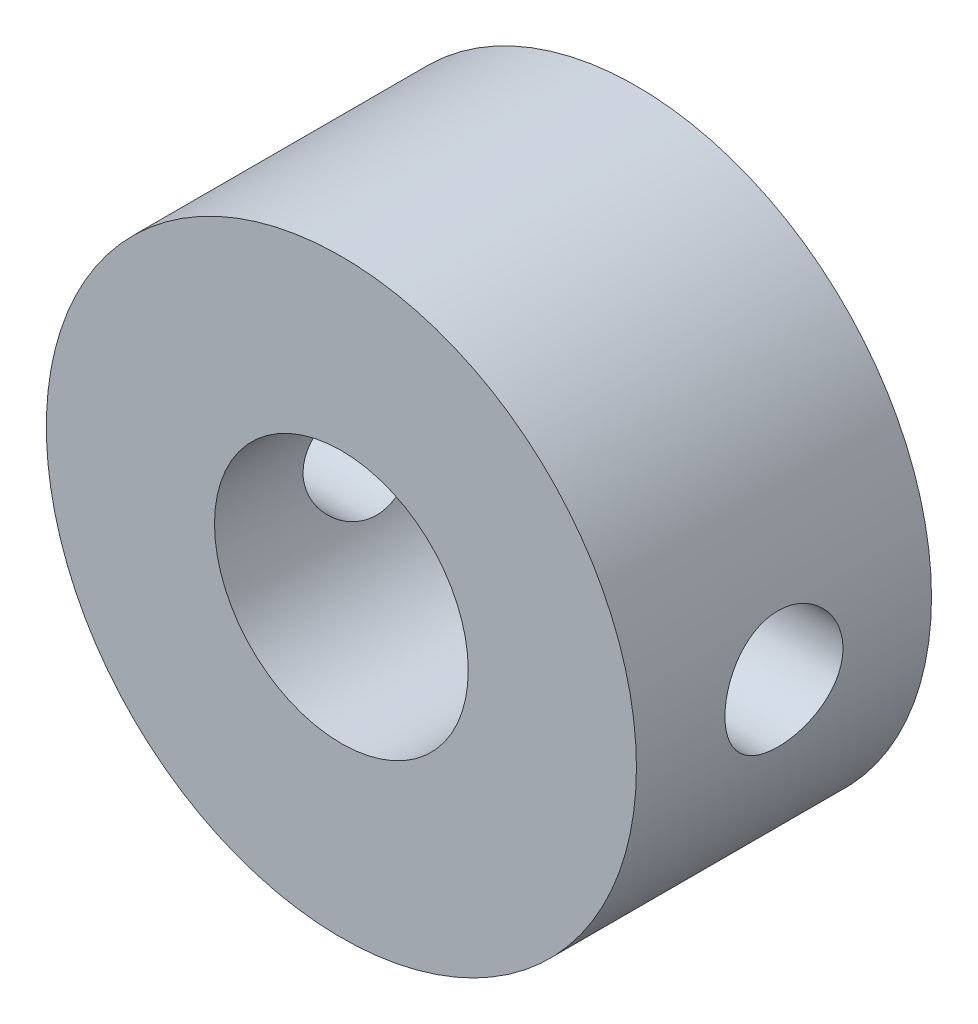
ISO-10303-21;
HEADER;
FILE_DESCRIPTION(('STEP AP214'),'2;1');
FILE_NAME('part.step','',(''),(''),'','','');
FILE_SCHEMA(('AUTOMOTIVE_DESIGN { 1 0 10303 214 1 1 1 1 }'));
ENDSEC;
DATA;
#1=APPLICATION_CONTEXT('core data for automotive mechanical design processes');
#2=APPLICATION_PROTOCOL_DEFINITION('international standard','automotive_design',2000,#1);
#3=PRODUCT_CONTEXT('',#1,'mechanical');
#4=PRODUCT('Part','Part','',(#3));
#5=PRODUCT_RELATED_PRODUCT_CATEGORY('part','',(#4));
#6=PRODUCT_DEFINITION_FORMATION('','',#4);
#7=PRODUCT_DEFINITION_CONTEXT('part definition',#1,'design');
#8=PRODUCT_DEFINITION('design','',#6,#7);
#9=PRODUCT_DEFINITION_SHAPE('','',#8);
#10=(LENGTH_UNIT() NAMED_UNIT(*) SI_UNIT(.MILLI.,.METRE.));
#11=(NAMED_UNIT(*) PLANE_ANGLE_UNIT() SI_UNIT($,.RADIAN.));
#12=(NAMED_UNIT(*) SI_UNIT($,.STERADIAN.) SOLID_ANGLE_UNIT());
#13=UNCERTAINTY_MEASURE_WITH_UNIT(LENGTH_MEASURE(1.E-05),#10,'distance_accuracy_value','');
#14=(GEOMETRIC_REPRESENTATION_CONTEXT(3) GLOBAL_UNCERTAINTY_ASSIGNED_CONTEXT((#13)) GLOBAL_UNIT_ASSIGNED_CONTEXT((#10,
#11,#12)) REPRESENTATION_CONTEXT('',''));
#15=CARTESIAN_POINT('',(0.,0.,0.));
#16=DIRECTION('',(0.,0.,1.));
#17=DIRECTION('',(1.,0.,0.));
#18=AXIS2_PLACEMENT_3D('',#15,#16,#17);
#19=CARTESIAN_POINT('',(0.,0.,5.));
#20=DIRECTION('',(0.,0.,-1.));
#21=DIRECTION('',(-1.,0.,0.));
#22=AXIS2_PLACEMENT_3D('',#19,#20,#21);
#23=CYLINDRICAL_SURFACE('',#22,5.);
#24=CARTESIAN_POINT('',(0.,0.,5.));
#25=DIRECTION('',(0.,0.,1.));
#26=DIRECTION('',(1.,0.,0.));
#27=AXIS2_PLACEMENT_3D('',#24,#25,#26);
#28=CIRCLE('',#27,5.);
#29=CARTESIAN_POINT('',(5.,0.,5.));
#30=VERTEX_POINT('',#29);
#31=EDGE_CURVE('E10',#30,#30,#28,.T.);
#32=ORIENTED_EDGE('',*,*,#31,.F.);
#33=EDGE_LOOP('',(#32));
#34=FACE_BOUND('',#33,.T.);
#35=CARTESIAN_POINT('',(0.,0.,0.));
#36=DIRECTION('',(0.,0.,1.));
#37=DIRECTION('',(1.,0.,0.));
#38=AXIS2_PLACEMENT_3D('',#35,#36,#37);
#39=CIRCLE('',#38,5.);
#40=CARTESIAN_POINT('',(5.,0.,0.));
#41=VERTEX_POINT('',#40);
#42=EDGE_CURVE('E43',#41,#41,#39,.T.);
#43=ORIENTED_EDGE('',*,*,#42,.T.);
#44=EDGE_LOOP('',(#43));
#45=FACE_BOUND('',#44,.T.);
#46=CARTESIAN_POINT('',(5.,0.,3.5));
#47=CARTESIAN_POINT('',(4.99999897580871,-0.0555769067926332,3.49999795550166));
#48=CARTESIAN_POINT('',(4.99906385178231,-0.111179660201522,3.49535115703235));
#49=CARTESIAN_POINT('',(4.99542365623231,-0.220813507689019,3.47690149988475));
#50=CARTESIAN_POINT('',(4.99271717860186,-0.274843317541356,3.46309136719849));
#51=CARTESIAN_POINT('',(4.98583649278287,-0.379730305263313,3.42675872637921));
#52=CARTESIAN_POINT('',(4.98166369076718,-0.430590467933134,3.40424456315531));
#53=CARTESIAN_POINT('',(4.97230398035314,-0.527807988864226,3.35116775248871));
#54=CARTESIAN_POINT('',(4.96711713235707,-0.574165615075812,3.32060558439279));
#55=CARTESIAN_POINT('',(4.9562216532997,-0.661693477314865,3.25186150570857));
#56=CARTESIAN_POINT('',(4.95050745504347,-0.702793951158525,3.2135916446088));
#57=CARTESIAN_POINT('',(4.93924180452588,-0.778036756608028,3.1307075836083));
#58=CARTESIAN_POINT('',(4.93369036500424,-0.812178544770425,3.08609288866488));
#59=CARTESIAN_POINT('',(4.92332441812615,-0.87283175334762,2.99128380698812));
#60=CARTESIAN_POINT('',(4.91851707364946,-0.899270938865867,2.94104235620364));
#61=CARTESIAN_POINT('',(4.91026268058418,-0.943305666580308,2.83671818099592));
#62=CARTESIAN_POINT('',(4.90681549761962,-0.960902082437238,2.78263583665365));
#63=CARTESIAN_POINT('',(4.90172805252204,-0.986525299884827,2.67291563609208));
#64=CARTESIAN_POINT('',(4.90006470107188,-0.994674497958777,2.61730745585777));
#65=CARTESIAN_POINT('',(4.89866375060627,-1.00155212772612,2.50549017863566));
#66=CARTESIAN_POINT('',(4.89892595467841,-1.0002815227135,2.44928114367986));
#67=CARTESIAN_POINT('',(4.90132551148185,-0.988454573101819,2.338753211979));
#68=CARTESIAN_POINT('',(4.90343452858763,-0.978038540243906,2.28441859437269));
#69=CARTESIAN_POINT('',(4.90924546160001,-0.948437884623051,2.178283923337));
#70=CARTESIAN_POINT('',(4.91294745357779,-0.929252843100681,2.12648399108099));
#71=CARTESIAN_POINT('',(4.92155618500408,-0.88252478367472,2.0264847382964));
#72=CARTESIAN_POINT('',(4.92647089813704,-0.854926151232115,1.97831212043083));
#73=CARTESIAN_POINT('',(4.93694618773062,-0.792193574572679,1.88722915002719));
#74=CARTESIAN_POINT('',(4.94250683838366,-0.757058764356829,1.84431940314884));
#75=CARTESIAN_POINT('',(4.95377021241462,-0.679499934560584,1.76417059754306));
#76=CARTESIAN_POINT('',(4.95947369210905,-0.636956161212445,1.72704743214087));
#77=CARTESIAN_POINT('',(4.97028848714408,-0.54618502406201,1.66044615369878));
#78=CARTESIAN_POINT('',(4.97539979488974,-0.497957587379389,1.63096813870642));
#79=CARTESIAN_POINT('',(4.98446690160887,-0.397059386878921,1.58047249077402));
#80=CARTESIAN_POINT('',(4.98842088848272,-0.3443818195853,1.55946810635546));
#81=CARTESIAN_POINT('',(4.99471408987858,-0.236148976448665,1.52663952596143));
#82=CARTESIAN_POINT('',(4.99705350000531,-0.180594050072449,1.51481421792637));
#83=CARTESIAN_POINT('',(4.99982671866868,-0.0691794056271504,1.50084354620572));
#84=CARTESIAN_POINT('',(5.0002917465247,-0.0133403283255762,1.49853958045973));
#85=CARTESIAN_POINT('',(4.99935051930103,0.0979249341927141,1.50324985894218));
#86=CARTESIAN_POINT('',(4.99794436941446,0.153351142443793,1.5102635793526));
#87=CARTESIAN_POINT('',(4.99343832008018,0.261705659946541,1.53327837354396));
#88=CARTESIAN_POINT('',(4.99035376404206,0.314651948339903,1.5491980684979));
#89=CARTESIAN_POINT('',(4.98283552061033,0.417123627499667,1.58948398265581));
#90=CARTESIAN_POINT('',(4.97840173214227,0.46664876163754,1.61385083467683));
#91=CARTESIAN_POINT('',(4.96859911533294,0.561541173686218,1.67068249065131));
#92=CARTESIAN_POINT('',(4.96321950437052,0.606850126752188,1.70324278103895));
#93=CARTESIAN_POINT('',(4.95214734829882,0.691418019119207,1.77540919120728));
#94=CARTESIAN_POINT('',(4.94645476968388,0.730676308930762,1.81501606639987));
#95=CARTESIAN_POINT('',(4.93529303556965,0.802640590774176,1.90087335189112));
#96=CARTESIAN_POINT('',(4.92982860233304,0.835237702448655,1.94721574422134));
#97=CARTESIAN_POINT('',(4.91984191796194,0.892185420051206,2.04481136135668));
#98=CARTESIAN_POINT('',(4.91531962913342,0.916536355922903,2.09606438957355));
#99=CARTESIAN_POINT('',(4.90776740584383,0.95615184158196,2.20176824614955));
#100=CARTESIAN_POINT('',(4.90472974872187,0.971463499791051,2.25620084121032));
#101=CARTESIAN_POINT('',(4.90047436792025,0.992708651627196,2.3669334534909));
#102=CARTESIAN_POINT('',(4.89925640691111,0.998643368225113,2.42323322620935));
#103=CARTESIAN_POINT('',(4.89879149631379,1.00092091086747,2.53500886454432));
#104=CARTESIAN_POINT('',(4.89950919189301,0.997435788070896,2.59048114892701));
#105=CARTESIAN_POINT('',(4.90275573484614,0.981352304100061,2.70003164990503));
#106=CARTESIAN_POINT('',(4.90528456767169,0.968754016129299,2.7541098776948));
#107=CARTESIAN_POINT('',(4.91185264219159,0.934878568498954,2.85922771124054));
#108=CARTESIAN_POINT('',(4.9158882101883,0.913622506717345,2.91027436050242));
#109=CARTESIAN_POINT('',(4.9250171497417,0.863054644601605,3.00810372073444));
#110=CARTESIAN_POINT('',(4.93011060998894,0.833742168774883,3.05488607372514));
#111=CARTESIAN_POINT('',(4.94088960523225,0.767305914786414,3.14371557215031));
#112=CARTESIAN_POINT('',(4.94658372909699,0.73005788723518,3.1856687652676));
#113=CARTESIAN_POINT('',(4.95786081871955,0.649064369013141,3.26278620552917));
#114=CARTESIAN_POINT('',(4.96344375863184,0.605317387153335,3.29794889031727));
#115=CARTESIAN_POINT('',(4.97393832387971,0.512017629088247,3.36083464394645));
#116=CARTESIAN_POINT('',(4.97884231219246,0.462408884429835,3.38847600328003));
#117=CARTESIAN_POINT('',(4.98735125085,0.359166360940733,3.43498612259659));
#118=CARTESIAN_POINT('',(4.99095737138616,0.305536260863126,3.45386278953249));
#119=CARTESIAN_POINT('',(4.99576372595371,0.209821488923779,3.47865194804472));
#120=CARTESIAN_POINT('',(4.99734303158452,0.168281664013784,3.48664319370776));
#121=CARTESIAN_POINT('',(4.99946154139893,0.0844995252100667,3.49731791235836));
#122=CARTESIAN_POINT('',(5.00000077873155,0.0422572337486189,3.50000155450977));
#123=CARTESIAN_POINT('',(5.,0.,3.5));
#124=B_SPLINE_CURVE_WITH_KNOTS('',3,(#46,#47,#48,#49,#50,#51,#52,#53,#54,#55,#56,#57,#58,#59,
#60,#61,#62,#63,#64,#65,#66,#67,#68,#69,#70,#71,#72,#73,#74,#75,#76,#77,#78,#79,#80,#81,#82,#83,
#84,#85,#86,#87,#88,#89,#90,#91,#92,#93,#94,#95,#96,#97,#98,#99,#100,#101,#102,#103,#104,#105,
#106,#107,#108,#109,#110,#111,#112,#113,#114,#115,#116,#117,#118,#119,#120,#121,#122,#123),
.UNSPECIFIED.,.T.,.F.,(4,2,2,2,2,2,2,2,2,2,2,2,2,2,2,2,2,2,2,2,2,2,2,2,2,2,2,2,2,2,2,2,2,2,2,2,
2,2,4),(0.,0.166576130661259,0.333284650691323,0.499833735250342,0.666372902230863,
0.834932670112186,1.00350559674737,1.17361195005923,1.34370149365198,1.51156185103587,
1.67940504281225,1.84471727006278,2.0100373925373,2.17647490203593,2.3429315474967,
2.51238252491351,2.6818356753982,2.85155274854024,3.02124925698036,3.18810735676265,
3.35495607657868,3.52030453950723,3.68566539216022,3.85305066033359,4.0204538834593,
4.19040628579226,4.36035188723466,4.52940381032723,4.69843368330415,4.86439722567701,
5.03035943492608,5.1959196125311,5.36149367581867,5.52988076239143,5.6983065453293,
5.86849496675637,6.03852955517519,6.16518775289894,6.29184191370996),.UNSPECIFIED.);
#125=CARTESIAN_POINT('',(5.,0.,3.5));
#126=VERTEX_POINT('',#125);
#127=EDGE_CURVE('E70',#126,#126,#124,.T.);
#128=ORIENTED_EDGE('',*,*,#127,.F.);
#129=EDGE_LOOP('',(#128));
#130=FACE_BOUND('',#129,.T.);
#131=CARTESIAN_POINT('',(-5.,0.,3.5));
#132=CARTESIAN_POINT('',(-4.99999897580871,0.0555769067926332,3.49999795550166));
#133=CARTESIAN_POINT('',(-4.99906385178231,0.111179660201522,3.49535115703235));
#134=CARTESIAN_POINT('',(-4.99542365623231,0.220813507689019,3.47690149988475));
#135=CARTESIAN_POINT('',(-4.99271717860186,0.274843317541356,3.46309136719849));
#136=CARTESIAN_POINT('',(-4.98583649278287,0.379730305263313,3.42675872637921));
#137=CARTESIAN_POINT('',(-4.98166369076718,0.430590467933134,3.40424456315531));
#138=CARTESIAN_POINT('',(-4.97230398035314,0.527807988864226,3.35116775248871));
#139=CARTESIAN_POINT('',(-4.96711713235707,0.574165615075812,3.32060558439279));
#140=CARTESIAN_POINT('',(-4.9562216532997,0.661693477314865,3.25186150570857));
#141=CARTESIAN_POINT('',(-4.95050745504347,0.702793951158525,3.2135916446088));
#142=CARTESIAN_POINT('',(-4.93924180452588,0.778036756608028,3.1307075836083));
#143=CARTESIAN_POINT('',(-4.93369036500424,0.812178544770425,3.08609288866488));
#144=CARTESIAN_POINT('',(-4.92332441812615,0.87283175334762,2.99128380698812));
#145=CARTESIAN_POINT('',(-4.91851707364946,0.899270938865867,2.94104235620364));
#146=CARTESIAN_POINT('',(-4.91026268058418,0.943305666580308,2.83671818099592));
#147=CARTESIAN_POINT('',(-4.90681549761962,0.960902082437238,2.78263583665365));
#148=CARTESIAN_POINT('',(-4.90172805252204,0.986525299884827,2.67291563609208));
#149=CARTESIAN_POINT('',(-4.90006470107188,0.994674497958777,2.61730745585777));
#150=CARTESIAN_POINT('',(-4.89866375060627,1.00155212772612,2.50549017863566));
#151=CARTESIAN_POINT('',(-4.89892595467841,1.0002815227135,2.44928114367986));
#152=CARTESIAN_POINT('',(-4.90132551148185,0.988454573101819,2.338753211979));
#153=CARTESIAN_POINT('',(-4.90343452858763,0.978038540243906,2.28441859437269));
#154=CARTESIAN_POINT('',(-4.90924546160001,0.948437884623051,2.178283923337));
#155=CARTESIAN_POINT('',(-4.91294745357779,0.929252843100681,2.12648399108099));
#156=CARTESIAN_POINT('',(-4.92155618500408,0.88252478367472,2.0264847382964));
#157=CARTESIAN_POINT('',(-4.92647089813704,0.854926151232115,1.97831212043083));
#158=CARTESIAN_POINT('',(-4.93694618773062,0.792193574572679,1.88722915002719));
#159=CARTESIAN_POINT('',(-4.94250683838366,0.757058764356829,1.84431940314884));
#160=CARTESIAN_POINT('',(-4.95377021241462,0.679499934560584,1.76417059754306));
#161=CARTESIAN_POINT('',(-4.95947369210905,0.636956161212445,1.72704743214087));
#162=CARTESIAN_POINT('',(-4.97028848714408,0.54618502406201,1.66044615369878));
#163=CARTESIAN_POINT('',(-4.97539979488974,0.497957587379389,1.63096813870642));
#164=CARTESIAN_POINT('',(-4.98446690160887,0.397059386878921,1.58047249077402));
#165=CARTESIAN_POINT('',(-4.98842088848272,0.3443818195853,1.55946810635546));
#166=CARTESIAN_POINT('',(-4.99471408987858,0.236148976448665,1.52663952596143));
#167=CARTESIAN_POINT('',(-4.99705350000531,0.180594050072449,1.51481421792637));
#168=CARTESIAN_POINT('',(-4.99982671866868,0.0691794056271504,1.50084354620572));
#169=CARTESIAN_POINT('',(-5.0002917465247,0.0133403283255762,1.49853958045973));
#170=CARTESIAN_POINT('',(-4.99935051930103,-0.0979249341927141,1.50324985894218));
#171=CARTESIAN_POINT('',(-4.99794436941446,-0.153351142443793,1.5102635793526));
#172=CARTESIAN_POINT('',(-4.99343832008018,-0.261705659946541,1.53327837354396));
#173=CARTESIAN_POINT('',(-4.99035376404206,-0.314651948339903,1.5491980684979));
#174=CARTESIAN_POINT('',(-4.98283552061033,-0.417123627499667,1.58948398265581));
#175=CARTESIAN_POINT('',(-4.97840173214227,-0.46664876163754,1.61385083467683));
#176=CARTESIAN_POINT('',(-4.96859911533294,-0.561541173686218,1.67068249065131));
#177=CARTESIAN_POINT('',(-4.96321950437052,-0.606850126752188,1.70324278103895));
#178=CARTESIAN_POINT('',(-4.95214734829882,-0.691418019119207,1.77540919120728));
#179=CARTESIAN_POINT('',(-4.94645476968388,-0.730676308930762,1.81501606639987));
#180=CARTESIAN_POINT('',(-4.93529303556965,-0.802640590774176,1.90087335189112));
#181=CARTESIAN_POINT('',(-4.92982860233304,-0.835237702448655,1.94721574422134));
#182=CARTESIAN_POINT('',(-4.91984191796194,-0.892185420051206,2.04481136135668));
#183=CARTESIAN_POINT('',(-4.91531962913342,-0.916536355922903,2.09606438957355));
#184=CARTESIAN_POINT('',(-4.90776740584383,-0.95615184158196,2.20176824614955));
#185=CARTESIAN_POINT('',(-4.90472974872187,-0.971463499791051,2.25620084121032));
#186=CARTESIAN_POINT('',(-4.90047436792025,-0.992708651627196,2.3669334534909));
#187=CARTESIAN_POINT('',(-4.89925640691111,-0.998643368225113,2.42323322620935));
#188=CARTESIAN_POINT('',(-4.89879149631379,-1.00092091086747,2.53500886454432));
#189=CARTESIAN_POINT('',(-4.89950919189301,-0.997435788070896,2.59048114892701));
#190=CARTESIAN_POINT('',(-4.90275573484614,-0.981352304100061,2.70003164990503));
#191=CARTESIAN_POINT('',(-4.90528456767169,-0.968754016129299,2.7541098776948));
#192=CARTESIAN_POINT('',(-4.91185264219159,-0.934878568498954,2.85922771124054));
#193=CARTESIAN_POINT('',(-4.9158882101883,-0.913622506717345,2.91027436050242));
#194=CARTESIAN_POINT('',(-4.9250171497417,-0.863054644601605,3.00810372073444));
#195=CARTESIAN_POINT('',(-4.93011060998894,-0.833742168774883,3.05488607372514));
#196=CARTESIAN_POINT('',(-4.94088960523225,-0.767305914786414,3.14371557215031));
#197=CARTESIAN_POINT('',(-4.94658372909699,-0.73005788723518,3.1856687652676));
#198=CARTESIAN_POINT('',(-4.95786081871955,-0.649064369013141,3.26278620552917));
#199=CARTESIAN_POINT('',(-4.96344375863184,-0.605317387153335,3.29794889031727));
#200=CARTESIAN_POINT('',(-4.97393832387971,-0.512017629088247,3.36083464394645));
#201=CARTESIAN_POINT('',(-4.97884231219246,-0.462408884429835,3.38847600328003));
#202=CARTESIAN_POINT('',(-4.98735125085,-0.359166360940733,3.43498612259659));
#203=CARTESIAN_POINT('',(-4.99095737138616,-0.305536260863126,3.45386278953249));
#204=CARTESIAN_POINT('',(-4.99576372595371,-0.209821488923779,3.47865194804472));
#205=CARTESIAN_POINT('',(-4.99734303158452,-0.168281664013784,3.48664319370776));
#206=CARTESIAN_POINT('',(-4.99946154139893,-0.0844995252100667,3.49731791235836));
#207=CARTESIAN_POINT('',(-5.00000077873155,-0.0422572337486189,3.50000155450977));
#208=CARTESIAN_POINT('',(-5.,0.,3.5));
#209=B_SPLINE_CURVE_WITH_KNOTS('',3,(#131,#132,#133,#134,#135,#136,#137,#138,#139,#140,#141,
#142,#143,#144,#145,#146,#147,#148,#149,#150,#151,#152,#153,#154,#155,#156,#157,#158,#159,#160,
#161,#162,#163,#164,#165,#166,#167,#168,#169,#170,#171,#172,#173,#174,#175,#176,#177,#178,#179,
#180,#181,#182,#183,#184,#185,#186,#187,#188,#189,#190,#191,#192,#193,#194,#195,#196,#197,#198,
#199,#200,#201,#202,#203,#204,#205,#206,#207,#208),.UNSPECIFIED.,.T.,.F.,(4,2,2,2,2,2,2,2,2,2,2,
2,2,2,2,2,2,2,2,2,2,2,2,2,2,2,2,2,2,2,2,2,2,2,2,2,2,2,4),(0.,0.166576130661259,
0.333284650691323,0.499833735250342,0.666372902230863,0.834932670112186,1.00350559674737,
1.17361195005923,1.34370149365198,1.51156185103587,1.67940504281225,1.84471727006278,
2.0100373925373,2.17647490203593,2.3429315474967,2.51238252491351,2.6818356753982,
2.85155274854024,3.02124925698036,3.18810735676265,3.35495607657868,3.52030453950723,
3.68566539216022,3.85305066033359,4.0204538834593,4.19040628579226,4.36035188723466,
4.52940381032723,4.69843368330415,4.86439722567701,5.03035943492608,5.1959196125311,
5.36149367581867,5.52988076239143,5.6983065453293,5.86849496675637,6.03852955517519,
6.16518775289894,6.29184191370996),.UNSPECIFIED.);
#210=CARTESIAN_POINT('',(-5.,0.,3.5));
#211=VERTEX_POINT('',#210);
#212=EDGE_CURVE('E74',#211,#211,#209,.T.);
#213=ORIENTED_EDGE('',*,*,#212,.F.);
#214=EDGE_LOOP('',(#213));
#215=FACE_BOUND('',#214,.T.);
#216=ADVANCED_FACE('F31',(#34,#45,#130,#215),#23,.T.);
#217=CARTESIAN_POINT('',(0.,0.,5.));
#218=DIRECTION('',(0.,0.,-1.));
#219=DIRECTION('',(-1.,0.,0.));
#220=AXIS2_PLACEMENT_3D('',#217,#218,#219);
#221=CYLINDRICAL_SURFACE('',#220,2.15);
#222=CARTESIAN_POINT('',(2.15,0.,3.5));
#223=CARTESIAN_POINT('',(2.14999759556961,-0.053001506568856,3.4999971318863));
#224=CARTESIAN_POINT('',(2.14801851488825,-0.106078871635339,3.49576143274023));
#225=CARTESIAN_POINT('',(2.14029774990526,-0.210691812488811,3.47899333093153));
#226=CARTESIAN_POINT('',(2.13454767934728,-0.262223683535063,3.4664424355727));
#227=CARTESIAN_POINT('',(2.11989230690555,-0.362068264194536,3.43362588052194));
#228=CARTESIAN_POINT('',(2.11099866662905,-0.410392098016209,3.41338871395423));
#229=CARTESIAN_POINT('',(2.09089355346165,-0.502899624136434,3.36590840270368));
#230=CARTESIAN_POINT('',(2.07968247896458,-0.547084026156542,3.33866646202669));
#231=CARTESIAN_POINT('',(2.05528503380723,-0.632767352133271,3.27625106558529));
#232=CARTESIAN_POINT('',(2.04202435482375,-0.673989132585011,3.24072655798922));
#233=CARTESIAN_POINT('',(2.01529750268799,-0.750138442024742,3.16350300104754));
#234=CARTESIAN_POINT('',(2.00183120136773,-0.785061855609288,3.12179994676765));
#235=CARTESIAN_POINT('',(1.97522637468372,-0.849874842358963,3.03015237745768));
#236=CARTESIAN_POINT('',(1.96216538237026,-0.879292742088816,2.97984927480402));
#237=CARTESIAN_POINT('',(1.93906689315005,-0.929128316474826,2.87432475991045));
#238=CARTESIAN_POINT('',(1.92902747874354,-0.949551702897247,2.81910649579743));
#239=CARTESIAN_POINT('',(1.91393290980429,-0.979607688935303,2.70848708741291));
#240=CARTESIAN_POINT('',(1.90863156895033,-0.989777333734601,2.65326696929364));
#241=CARTESIAN_POINT('',(1.90292984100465,-1.00069989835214,2.54166993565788));
#242=CARTESIAN_POINT('',(1.90252567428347,-1.0014600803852,2.48529394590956));
#243=CARTESIAN_POINT('',(1.90646107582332,-0.993939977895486,2.37902633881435));
#244=CARTESIAN_POINT('',(1.91033037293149,-0.986556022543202,2.32904998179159));
#245=CARTESIAN_POINT('',(1.92156538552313,-0.964488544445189,2.23114881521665));
#246=CARTESIAN_POINT('',(1.92893199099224,-0.94980316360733,2.18322453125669));
#247=CARTESIAN_POINT('',(1.94650211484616,-0.913261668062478,2.08945791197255));
#248=CARTESIAN_POINT('',(1.95676705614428,-0.891248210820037,2.04368893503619));
#249=CARTESIAN_POINT('',(1.97897189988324,-0.840790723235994,1.95629049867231));
#250=CARTESIAN_POINT('',(1.9909125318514,-0.812343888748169,1.91466285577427));
#251=CARTESIAN_POINT('',(2.01668318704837,-0.746241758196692,1.83200562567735));
#252=CARTESIAN_POINT('',(2.03057814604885,-0.707924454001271,1.79152398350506));
#253=CARTESIAN_POINT('',(2.05763067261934,-0.624947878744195,1.717351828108));
#254=CARTESIAN_POINT('',(2.07078797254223,-0.580286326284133,1.68366376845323));
#255=CARTESIAN_POINT('',(2.09545383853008,-0.483871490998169,1.62294559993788));
#256=CARTESIAN_POINT('',(2.10688815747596,-0.43192405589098,1.59619127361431));
#257=CARTESIAN_POINT('',(2.12621796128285,-0.323597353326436,1.55200220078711));
#258=CARTESIAN_POINT('',(2.13411588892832,-0.267221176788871,1.53456101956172));
#259=CARTESIAN_POINT('',(2.14499159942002,-0.156167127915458,1.5107620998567));
#260=CARTESIAN_POINT('',(2.14829341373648,-0.101677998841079,1.50367246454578));
#261=CARTESIAN_POINT('',(2.15068187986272,0.00780879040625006,1.49853160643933));
#262=CARTESIAN_POINT('',(2.14977015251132,0.062806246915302,1.50047690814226));
#263=CARTESIAN_POINT('',(2.14403418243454,0.167966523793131,1.51287865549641));
#264=CARTESIAN_POINT('',(2.13946785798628,0.218211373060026,1.52277419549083));
#265=CARTESIAN_POINT('',(2.12718828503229,0.316246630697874,1.54995969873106));
#266=CARTESIAN_POINT('',(2.11947466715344,0.364036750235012,1.56725052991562));
#267=CARTESIAN_POINT('',(2.1013200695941,0.457482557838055,1.60926146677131));
#268=CARTESIAN_POINT('',(2.09080262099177,0.503027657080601,1.63419337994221));
#269=CARTESIAN_POINT('',(2.06810272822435,0.589449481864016,1.69054732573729));
#270=CARTESIAN_POINT('',(2.05591955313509,0.63032414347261,1.72197221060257));
#271=CARTESIAN_POINT('',(2.02984851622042,0.710015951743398,1.79360586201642));
#272=CARTESIAN_POINT('',(2.01590469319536,0.748341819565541,1.83434201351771));
#273=CARTESIAN_POINT('',(1.98874266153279,0.817799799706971,1.92179286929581));
#274=CARTESIAN_POINT('',(1.97552479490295,0.848928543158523,1.96851035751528));
#275=CARTESIAN_POINT('',(1.950958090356,0.903992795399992,2.06854114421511));
#276=CARTESIAN_POINT('',(1.93968194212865,0.927668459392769,2.12201679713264));
#277=CARTESIAN_POINT('',(1.92116526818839,0.96543977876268,2.23289311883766));
#278=CARTESIAN_POINT('',(1.91392031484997,0.979545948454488,2.29028940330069));
#279=CARTESIAN_POINT('',(1.90507946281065,0.996622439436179,2.40183653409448));
#280=CARTESIAN_POINT('',(1.9030347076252,1.00047899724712,2.45581598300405));
#281=CARTESIAN_POINT('',(1.90358836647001,0.999426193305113,2.56365784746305));
#282=CARTESIAN_POINT('',(1.9061855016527,0.994519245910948,2.61752029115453));
#283=CARTESIAN_POINT('',(1.91528058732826,0.976875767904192,2.71954940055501));
#284=CARTESIAN_POINT('',(1.92148440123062,0.964728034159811,2.76784702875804));
#285=CARTESIAN_POINT('',(1.93679576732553,0.933606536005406,2.86169714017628));
#286=CARTESIAN_POINT('',(1.9459041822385,0.914630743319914,2.90724880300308));
#287=CARTESIAN_POINT('',(1.96674023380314,0.868965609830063,2.99762392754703));
#288=CARTESIAN_POINT('',(1.97860123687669,0.841849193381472,3.04220007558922));
#289=CARTESIAN_POINT('',(2.00332357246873,0.781195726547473,3.1264423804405));
#290=CARTESIAN_POINT('',(2.01618536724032,0.747655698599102,3.16610624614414));
#291=CARTESIAN_POINT('',(2.04299290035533,0.671176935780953,3.24348244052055));
#292=CARTESIAN_POINT('',(2.05691927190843,0.627635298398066,3.28060868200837));
#293=CARTESIAN_POINT('',(2.08306666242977,0.534481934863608,3.34711473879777));
#294=CARTESIAN_POINT('',(2.09528687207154,0.484867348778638,3.37649088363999));
#295=CARTESIAN_POINT('',(2.11661728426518,0.381079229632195,3.42632264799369));
#296=CARTESIAN_POINT('',(2.12574515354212,0.326933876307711,3.44682913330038));
#297=CARTESIAN_POINT('',(2.13990389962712,0.215503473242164,3.47820640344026));
#298=CARTESIAN_POINT('',(2.14494698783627,0.158228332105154,3.48910591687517));
#299=CARTESIAN_POINT('',(2.14843372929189,0.0837568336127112,3.49662828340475));
#300=CARTESIAN_POINT('',(2.14901991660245,0.067038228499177,3.4978913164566));
#301=CARTESIAN_POINT('',(2.1498034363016,0.0335489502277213,3.49957763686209));
#302=CARTESIAN_POINT('',(2.15000076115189,0.0167782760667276,3.50000090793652));
#303=CARTESIAN_POINT('',(2.15,0.,3.5));
#304=B_SPLINE_CURVE_WITH_KNOTS('',3,(#222,#223,#224,#225,#226,#227,#228,#229,#230,#231,#232,
#233,#234,#235,#236,#237,#238,#239,#240,#241,#242,#243,#244,#245,#246,#247,#248,#249,#250,#251,
#252,#253,#254,#255,#256,#257,#258,#259,#260,#261,#262,#263,#264,#265,#266,#267,#268,#269,#270,
#271,#272,#273,#274,#275,#276,#277,#278,#279,#280,#281,#282,#283,#284,#285,#286,#287,#288,#289,
#290,#291,#292,#293,#294,#295,#296,#297,#298,#299,#300,#301,#302,#303),.UNSPECIFIED.,.T.,.F.,(4,
2,2,2,2,2,2,2,2,2,2,2,2,2,2,2,2,2,2,2,2,2,2,2,2,2,2,2,2,2,2,2,2,2,2,2,2,2,2,2,4),(0.,
0.158935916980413,0.318226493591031,0.476932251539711,0.635610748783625,0.802927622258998,
0.970353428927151,1.14860802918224,1.32674926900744,1.49498139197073,1.66308366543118,
1.8143778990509,1.96571065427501,2.12052835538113,2.27541366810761,2.44699119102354,
2.61863057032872,2.79630560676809,2.97385772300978,3.1381197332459,3.30231856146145,
3.45585453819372,3.60940853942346,3.76767725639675,3.92601564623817,4.09817939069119,
4.27042356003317,4.44813798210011,4.62565682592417,4.78723468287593,4.94876803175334,
5.09867799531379,5.24863252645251,5.40850249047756,5.56844673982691,5.74429288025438,
5.92022215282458,6.09512867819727,6.269510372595,6.3198225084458,6.37013561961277),.UNSPECIFIED.);
#305=CARTESIAN_POINT('',(2.15,0.,3.5));
#306=VERTEX_POINT('',#305);
#307=EDGE_CURVE('E53',#306,#306,#304,.T.);
#308=ORIENTED_EDGE('',*,*,#307,.T.);
#309=EDGE_LOOP('',(#308));
#310=FACE_BOUND('',#309,.T.);
#311=CARTESIAN_POINT('',(0.,0.,5.));
#312=DIRECTION('',(0.,0.,1.));
#313=DIRECTION('',(1.,0.,0.));
#314=AXIS2_PLACEMENT_3D('',#311,#312,#313);
#315=CIRCLE('',#314,2.15);
#316=CARTESIAN_POINT('',(2.15,0.,5.));
#317=VERTEX_POINT('',#316);
#318=EDGE_CURVE('E48',#317,#317,#315,.T.);
#319=ORIENTED_EDGE('',*,*,#318,.T.);
#320=EDGE_LOOP('',(#319));
#321=FACE_BOUND('',#320,.T.);
#322=CARTESIAN_POINT('',(0.,0.,0.));
#323=DIRECTION('',(0.,0.,1.));
#324=DIRECTION('',(1.,0.,0.));
#325=AXIS2_PLACEMENT_3D('',#322,#323,#324);
#326=CIRCLE('',#325,2.15);
#327=CARTESIAN_POINT('',(2.15,0.,0.));
#328=VERTEX_POINT('',#327);
#329=EDGE_CURVE('E51',#328,#328,#326,.T.);
#330=ORIENTED_EDGE('',*,*,#329,.F.);
#331=EDGE_LOOP('',(#330));
#332=FACE_BOUND('',#331,.T.);
#333=CARTESIAN_POINT('',(-2.15,0.,3.5));
#334=CARTESIAN_POINT('',(-2.14999759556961,0.053001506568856,3.4999971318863));
#335=CARTESIAN_POINT('',(-2.14801851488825,0.106078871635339,3.49576143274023));
#336=CARTESIAN_POINT('',(-2.14029774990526,0.210691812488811,3.47899333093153));
#337=CARTESIAN_POINT('',(-2.13454767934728,0.262223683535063,3.4664424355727));
#338=CARTESIAN_POINT('',(-2.11989230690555,0.362068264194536,3.43362588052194));
#339=CARTESIAN_POINT('',(-2.11099866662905,0.410392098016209,3.41338871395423));
#340=CARTESIAN_POINT('',(-2.09089355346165,0.502899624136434,3.36590840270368));
#341=CARTESIAN_POINT('',(-2.07968247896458,0.547084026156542,3.33866646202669));
#342=CARTESIAN_POINT('',(-2.05528503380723,0.632767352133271,3.27625106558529));
#343=CARTESIAN_POINT('',(-2.04202435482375,0.673989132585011,3.24072655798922));
#344=CARTESIAN_POINT('',(-2.01529750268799,0.750138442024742,3.16350300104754));
#345=CARTESIAN_POINT('',(-2.00183120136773,0.785061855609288,3.12179994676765));
#346=CARTESIAN_POINT('',(-1.97522637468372,0.849874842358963,3.03015237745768));
#347=CARTESIAN_POINT('',(-1.96216538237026,0.879292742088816,2.97984927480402));
#348=CARTESIAN_POINT('',(-1.93906689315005,0.929128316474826,2.87432475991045));
#349=CARTESIAN_POINT('',(-1.92902747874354,0.949551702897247,2.81910649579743));
#350=CARTESIAN_POINT('',(-1.91393290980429,0.979607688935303,2.70848708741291));
#351=CARTESIAN_POINT('',(-1.90863156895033,0.989777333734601,2.65326696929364));
#352=CARTESIAN_POINT('',(-1.90292984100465,1.00069989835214,2.54166993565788));
#353=CARTESIAN_POINT('',(-1.90252567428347,1.0014600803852,2.48529394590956));
#354=CARTESIAN_POINT('',(-1.90646107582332,0.993939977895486,2.37902633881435));
#355=CARTESIAN_POINT('',(-1.91033037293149,0.986556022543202,2.32904998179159));
#356=CARTESIAN_POINT('',(-1.92156538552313,0.964488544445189,2.23114881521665));
#357=CARTESIAN_POINT('',(-1.92893199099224,0.94980316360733,2.18322453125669));
#358=CARTESIAN_POINT('',(-1.94650211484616,0.913261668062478,2.08945791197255));
#359=CARTESIAN_POINT('',(-1.95676705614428,0.891248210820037,2.04368893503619));
#360=CARTESIAN_POINT('',(-1.97897189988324,0.840790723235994,1.95629049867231));
#361=CARTESIAN_POINT('',(-1.9909125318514,0.812343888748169,1.91466285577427));
#362=CARTESIAN_POINT('',(-2.01668318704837,0.746241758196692,1.83200562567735));
#363=CARTESIAN_POINT('',(-2.03057814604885,0.707924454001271,1.79152398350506));
#364=CARTESIAN_POINT('',(-2.05763067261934,0.624947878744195,1.717351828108));
#365=CARTESIAN_POINT('',(-2.07078797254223,0.580286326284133,1.68366376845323));
#366=CARTESIAN_POINT('',(-2.09545383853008,0.483871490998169,1.62294559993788));
#367=CARTESIAN_POINT('',(-2.10688815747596,0.43192405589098,1.59619127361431));
#368=CARTESIAN_POINT('',(-2.12621796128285,0.323597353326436,1.55200220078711));
#369=CARTESIAN_POINT('',(-2.13411588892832,0.267221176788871,1.53456101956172));
#370=CARTESIAN_POINT('',(-2.14499159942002,0.156167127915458,1.5107620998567));
#371=CARTESIAN_POINT('',(-2.14829341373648,0.101677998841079,1.50367246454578));
#372=CARTESIAN_POINT('',(-2.15068187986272,-0.00780879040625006,1.49853160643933));
#373=CARTESIAN_POINT('',(-2.14977015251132,-0.062806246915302,1.50047690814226));
#374=CARTESIAN_POINT('',(-2.14403418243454,-0.167966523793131,1.51287865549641));
#375=CARTESIAN_POINT('',(-2.13946785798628,-0.218211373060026,1.52277419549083));
#376=CARTESIAN_POINT('',(-2.12718828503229,-0.316246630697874,1.54995969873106));
#377=CARTESIAN_POINT('',(-2.11947466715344,-0.364036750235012,1.56725052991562));
#378=CARTESIAN_POINT('',(-2.1013200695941,-0.457482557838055,1.60926146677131));
#379=CARTESIAN_POINT('',(-2.09080262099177,-0.503027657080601,1.63419337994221));
#380=CARTESIAN_POINT('',(-2.06810272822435,-0.589449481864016,1.69054732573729));
#381=CARTESIAN_POINT('',(-2.05591955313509,-0.63032414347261,1.72197221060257));
#382=CARTESIAN_POINT('',(-2.02984851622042,-0.710015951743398,1.79360586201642));
#383=CARTESIAN_POINT('',(-2.01590469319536,-0.748341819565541,1.83434201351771));
#384=CARTESIAN_POINT('',(-1.98874266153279,-0.817799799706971,1.92179286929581));
#385=CARTESIAN_POINT('',(-1.97552479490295,-0.848928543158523,1.96851035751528));
#386=CARTESIAN_POINT('',(-1.950958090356,-0.903992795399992,2.06854114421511));
#387=CARTESIAN_POINT('',(-1.93968194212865,-0.927668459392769,2.12201679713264));
#388=CARTESIAN_POINT('',(-1.92116526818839,-0.96543977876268,2.23289311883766));
#389=CARTESIAN_POINT('',(-1.91392031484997,-0.979545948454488,2.29028940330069));
#390=CARTESIAN_POINT('',(-1.90507946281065,-0.996622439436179,2.40183653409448));
#391=CARTESIAN_POINT('',(-1.9030347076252,-1.00047899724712,2.45581598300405));
#392=CARTESIAN_POINT('',(-1.90358836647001,-0.999426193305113,2.56365784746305));
#393=CARTESIAN_POINT('',(-1.9061855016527,-0.994519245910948,2.61752029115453));
#394=CARTESIAN_POINT('',(-1.91528058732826,-0.976875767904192,2.71954940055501));
#395=CARTESIAN_POINT('',(-1.92148440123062,-0.964728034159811,2.76784702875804));
#396=CARTESIAN_POINT('',(-1.93679576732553,-0.933606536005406,2.86169714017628));
#397=CARTESIAN_POINT('',(-1.9459041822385,-0.914630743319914,2.90724880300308));
#398=CARTESIAN_POINT('',(-1.96674023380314,-0.868965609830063,2.99762392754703));
#399=CARTESIAN_POINT('',(-1.97860123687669,-0.841849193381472,3.04220007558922));
#400=CARTESIAN_POINT('',(-2.00332357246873,-0.781195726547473,3.1264423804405));
#401=CARTESIAN_POINT('',(-2.01618536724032,-0.747655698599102,3.16610624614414));
#402=CARTESIAN_POINT('',(-2.04299290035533,-0.671176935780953,3.24348244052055));
#403=CARTESIAN_POINT('',(-2.05691927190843,-0.627635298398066,3.28060868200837));
#404=CARTESIAN_POINT('',(-2.08306666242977,-0.534481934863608,3.34711473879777));
#405=CARTESIAN_POINT('',(-2.09528687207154,-0.484867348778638,3.37649088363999));
#406=CARTESIAN_POINT('',(-2.11661728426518,-0.381079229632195,3.42632264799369));
#407=CARTESIAN_POINT('',(-2.12574515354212,-0.326933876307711,3.44682913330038));
#408=CARTESIAN_POINT('',(-2.13990389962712,-0.215503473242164,3.47820640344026));
#409=CARTESIAN_POINT('',(-2.14494698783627,-0.158228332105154,3.48910591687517));
#410=CARTESIAN_POINT('',(-2.14843372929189,-0.0837568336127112,3.49662828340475));
#411=CARTESIAN_POINT('',(-2.14901991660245,-0.067038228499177,3.4978913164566));
#412=CARTESIAN_POINT('',(-2.1498034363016,-0.0335489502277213,3.49957763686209));
#413=CARTESIAN_POINT('',(-2.15000076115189,-0.0167782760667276,3.50000090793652));
#414=CARTESIAN_POINT('',(-2.15,0.,3.5));
#415=B_SPLINE_CURVE_WITH_KNOTS('',3,(#333,#334,#335,#336,#337,#338,#339,#340,#341,#342,#343,
#344,#345,#346,#347,#348,#349,#350,#351,#352,#353,#354,#355,#356,#357,#358,#359,#360,#361,#362,
#363,#364,#365,#366,#367,#368,#369,#370,#371,#372,#373,#374,#375,#376,#377,#378,#379,#380,#381,
#382,#383,#384,#385,#386,#387,#388,#389,#390,#391,#392,#393,#394,#395,#396,#397,#398,#399,#400,
#401,#402,#403,#404,#405,#406,#407,#408,#409,#410,#411,#412,#413,#414),.UNSPECIFIED.,.T.,.F.,(4,
2,2,2,2,2,2,2,2,2,2,2,2,2,2,2,2,2,2,2,2,2,2,2,2,2,2,2,2,2,2,2,2,2,2,2,2,2,2,2,4),(0.,
0.158935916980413,0.318226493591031,0.476932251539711,0.635610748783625,0.802927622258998,
0.970353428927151,1.14860802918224,1.32674926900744,1.49498139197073,1.66308366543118,
1.8143778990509,1.96571065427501,2.12052835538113,2.27541366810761,2.44699119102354,
2.61863057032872,2.79630560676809,2.97385772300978,3.1381197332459,3.30231856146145,
3.45585453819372,3.60940853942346,3.76767725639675,3.92601564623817,4.09817939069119,
4.27042356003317,4.44813798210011,4.62565682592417,4.78723468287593,4.94876803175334,
5.09867799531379,5.24863252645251,5.40850249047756,5.56844673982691,5.74429288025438,
5.92022215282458,6.09512867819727,6.269510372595,6.3198225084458,6.37013561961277),.UNSPECIFIED.);
#416=CARTESIAN_POINT('',(-2.15,0.,3.5));
#417=VERTEX_POINT('',#416);
#418=EDGE_CURVE('E35',#417,#417,#415,.T.);
#419=ORIENTED_EDGE('',*,*,#418,.T.);
#420=EDGE_LOOP('',(#419));
#421=FACE_BOUND('',#420,.T.);
#422=ADVANCED_FACE('F57',(#310,#321,#332,#421),#221,.F.);
#423=CARTESIAN_POINT('',(0.,0.,5.));
#424=DIRECTION('',(0.,0.,1.));
#425=DIRECTION('',(1.,0.,0.));
#426=AXIS2_PLACEMENT_3D('',#423,#424,#425);
#427=PLANE('',#426);
#428=ORIENTED_EDGE('',*,*,#31,.T.);
#429=EDGE_LOOP('',(#428));
#430=FACE_BOUND('',#429,.T.);
#431=ORIENTED_EDGE('',*,*,#318,.F.);
#432=EDGE_LOOP('',(#431));
#433=FACE_BOUND('',#432,.T.);
#434=ADVANCED_FACE('F88',(#430,#433),#427,.T.);
#435=CARTESIAN_POINT('',(0.,0.,0.));
#436=DIRECTION('',(0.,0.,1.));
#437=DIRECTION('',(1.,0.,0.));
#438=AXIS2_PLACEMENT_3D('',#435,#436,#437);
#439=PLANE('',#438);
#440=ORIENTED_EDGE('',*,*,#42,.F.);
#441=EDGE_LOOP('',(#440));
#442=FACE_BOUND('',#441,.T.);
#443=ORIENTED_EDGE('',*,*,#329,.T.);
#444=EDGE_LOOP('',(#443));
#445=FACE_BOUND('',#444,.T.);
#446=ADVANCED_FACE('F84',(#442,#445),#439,.F.);
#447=CARTESIAN_POINT('',(10.,0.,2.5));
#448=DIRECTION('',(-1.,0.,0.));
#449=DIRECTION('',(0.,0.,1.));
#450=AXIS2_PLACEMENT_3D('',#447,#448,#449);
#451=CYLINDRICAL_SURFACE('',#450,1.);
#452=ORIENTED_EDGE('',*,*,#307,.F.);
#453=EDGE_LOOP('',(#452));
#454=FACE_BOUND('',#453,.T.);
#455=ORIENTED_EDGE('',*,*,#127,.T.);
#456=EDGE_LOOP('',(#455));
#457=FACE_BOUND('',#456,.T.);
#458=ADVANCED_FACE('F63',(#454,#457),#451,.F.);
#459=ORIENTED_EDGE('',*,*,#418,.F.);
#460=EDGE_LOOP('',(#459));
#461=FACE_BOUND('',#460,.T.);
#462=ORIENTED_EDGE('',*,*,#212,.T.);
#463=EDGE_LOOP('',(#462));
#464=FACE_BOUND('',#463,.T.);
#465=ADVANCED_FACE('F60',(#461,#464),#451,.F.);
#466=CLOSED_SHELL('',(#216,#422,#434,#446,#458,#465));
#467=MANIFOLD_SOLID_BREP('B2',#466);
#468=ADVANCED_BREP_SHAPE_REPRESENTATION('',(#18,#467),#14);
#469=SHAPE_DEFINITION_REPRESENTATION(#9,#468);
ENDSEC;
END-ISO-10303-21;
